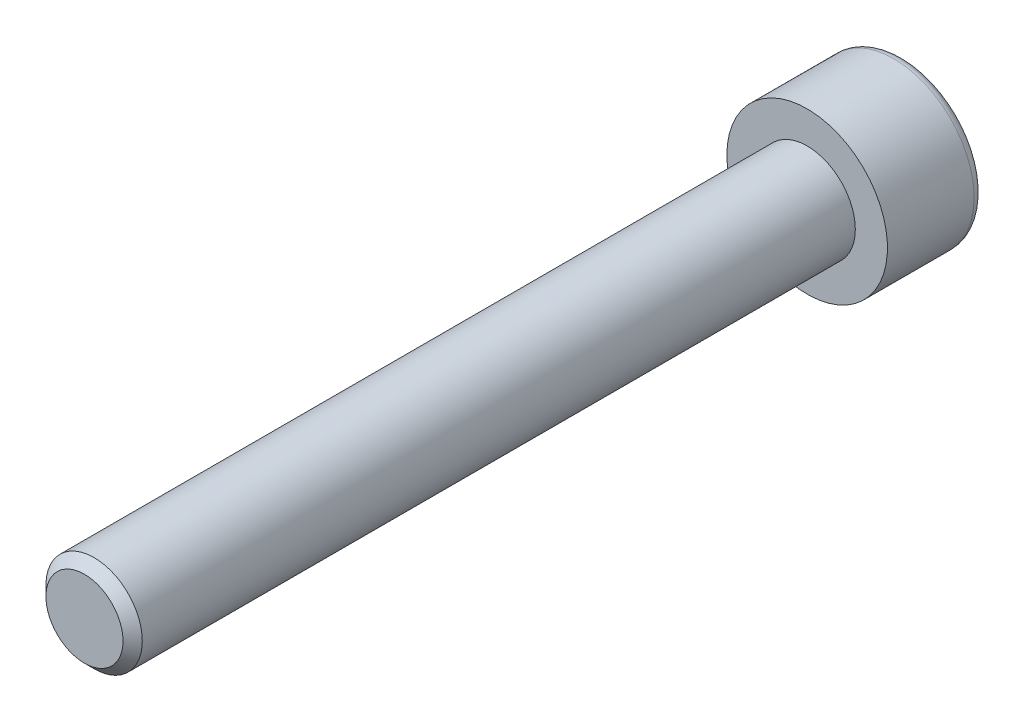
ISO-10303-21;
HEADER;
FILE_DESCRIPTION(('STEP AP214'),'2;1');
FILE_NAME('part.step','',(''),(''),'','','');
FILE_SCHEMA(('AUTOMOTIVE_DESIGN { 1 0 10303 214 1 1 1 1 }'));
ENDSEC;
DATA;
#1=APPLICATION_CONTEXT('core data for automotive mechanical design processes');
#2=APPLICATION_PROTOCOL_DEFINITION('international standard','automotive_design',2000,#1);
#3=PRODUCT_CONTEXT('',#1,'mechanical');
#4=PRODUCT('Part','Part','',(#3));
#5=PRODUCT_RELATED_PRODUCT_CATEGORY('part','',(#4));
#6=PRODUCT_DEFINITION_FORMATION('','',#4);
#7=PRODUCT_DEFINITION_CONTEXT('part definition',#1,'design');
#8=PRODUCT_DEFINITION('design','',#6,#7);
#9=PRODUCT_DEFINITION_SHAPE('','',#8);
#10=(LENGTH_UNIT() NAMED_UNIT(*) SI_UNIT(.MILLI.,.METRE.));
#11=(NAMED_UNIT(*) PLANE_ANGLE_UNIT() SI_UNIT($,.RADIAN.));
#12=(NAMED_UNIT(*) SI_UNIT($,.STERADIAN.) SOLID_ANGLE_UNIT());
#13=UNCERTAINTY_MEASURE_WITH_UNIT(LENGTH_MEASURE(1.E-05),#10,'distance_accuracy_value','');
#14=(GEOMETRIC_REPRESENTATION_CONTEXT(3) GLOBAL_UNCERTAINTY_ASSIGNED_CONTEXT((#13)) GLOBAL_UNIT_ASSIGNED_CONTEXT((#10,
#11,#12)) REPRESENTATION_CONTEXT('',''));
#15=CARTESIAN_POINT('',(0.,0.,0.));
#16=DIRECTION('',(0.,0.,1.));
#17=DIRECTION('',(1.,0.,0.));
#18=AXIS2_PLACEMENT_3D('',#15,#16,#17);
#19=CARTESIAN_POINT('',(0.,0.,-6.));
#20=DIRECTION('',(0.,0.,1.));
#21=DIRECTION('',(1.,0.,0.));
#22=AXIS2_PLACEMENT_3D('',#19,#20,#21);
#23=PLANE('',#22);
#24=CARTESIAN_POINT('',(0.,0.,-6.));
#25=DIRECTION('',(0.,0.,-1.));
#26=DIRECTION('',(-1.,0.,0.));
#27=AXIS2_PLACEMENT_3D('',#24,#25,#26);
#28=CIRCLE('',#27,4.4);
#29=CARTESIAN_POINT('',(-4.4,0.,-6.));
#30=VERTEX_POINT('',#29);
#31=EDGE_CURVE('E144',#30,#30,#28,.T.);
#32=ORIENTED_EDGE('',*,*,#31,.T.);
#33=EDGE_LOOP('',(#32));
#34=FACE_BOUND('',#33,.T.);
#35=DIRECTION('',(-0.86602540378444,0.499999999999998,0.));
#36=VECTOR('',#35,1.);
#37=CARTESIAN_POINT('',(0.,2.88675134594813,-6.));
#38=LINE('',#37,#36);
#39=CARTESIAN_POINT('',(2.5,1.44337567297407,-6.));
#40=VERTEX_POINT('',#39);
#41=CARTESIAN_POINT('',(0.,2.88675134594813,-6.));
#42=VERTEX_POINT('',#41);
#43=EDGE_CURVE('E46',#40,#42,#38,.T.);
#44=ORIENTED_EDGE('',*,*,#43,.T.);
#45=DIRECTION('',(-0.866025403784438,-0.500000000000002,0.));
#46=VECTOR('',#45,1.);
#47=CARTESIAN_POINT('',(0.,2.88675134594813,-6.));
#48=LINE('',#47,#46);
#49=CARTESIAN_POINT('',(-2.5,1.44337567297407,-6.));
#50=VERTEX_POINT('',#49);
#51=EDGE_CURVE('E117',#42,#50,#48,.T.);
#52=ORIENTED_EDGE('',*,*,#51,.T.);
#53=DIRECTION('',(0.,-1.,0.));
#54=VECTOR('',#53,1.);
#55=CARTESIAN_POINT('',(-2.5,-1.44337567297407,-6.));
#56=LINE('',#55,#54);
#57=CARTESIAN_POINT('',(-2.5,-1.44337567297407,-6.));
#58=VERTEX_POINT('',#57);
#59=EDGE_CURVE('E121',#50,#58,#56,.T.);
#60=ORIENTED_EDGE('',*,*,#59,.T.);
#61=DIRECTION('',(0.866025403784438,-0.500000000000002,0.));
#62=VECTOR('',#61,1.);
#63=CARTESIAN_POINT('',(0.,-2.88675134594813,-6.));
#64=LINE('',#63,#62);
#65=CARTESIAN_POINT('',(0.,-2.88675134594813,-6.));
#66=VERTEX_POINT('',#65);
#67=EDGE_CURVE('E124',#58,#66,#64,.T.);
#68=ORIENTED_EDGE('',*,*,#67,.T.);
#69=DIRECTION('',(0.86602540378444,0.499999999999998,0.));
#70=VECTOR('',#69,1.);
#71=CARTESIAN_POINT('',(0.,-2.88675134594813,-6.));
#72=LINE('',#71,#70);
#73=CARTESIAN_POINT('',(2.5,-1.44337567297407,-6.));
#74=VERTEX_POINT('',#73);
#75=EDGE_CURVE('E107',#66,#74,#72,.T.);
#76=ORIENTED_EDGE('',*,*,#75,.T.);
#77=DIRECTION('',(0.,1.,0.));
#78=VECTOR('',#77,1.);
#79=CARTESIAN_POINT('',(2.5,-1.44337567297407,-6.));
#80=LINE('',#79,#78);
#81=EDGE_CURVE('E127',#74,#40,#80,.T.);
#82=ORIENTED_EDGE('',*,*,#81,.T.);
#83=EDGE_LOOP('',(#44,#52,#60,#68,#76,#82));
#84=FACE_BOUND('',#83,.T.);
#85=ADVANCED_FACE('F31',(#34,#84),#23,.F.);
#86=CARTESIAN_POINT('',(0.,0.,-5.4));
#87=DIRECTION('',(0.,0.,-1.));
#88=DIRECTION('',(-1.,0.,0.));
#89=AXIS2_PLACEMENT_3D('',#86,#87,#88);
#90=TOROIDAL_SURFACE('',#89,4.4,0.600000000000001);
#91=ORIENTED_EDGE('',*,*,#31,.F.);
#92=EDGE_LOOP('',(#91));
#93=FACE_BOUND('',#92,.T.);
#94=CARTESIAN_POINT('',(0.,0.,-5.4));
#95=DIRECTION('',(0.,0.,-1.));
#96=DIRECTION('',(-1.,0.,0.));
#97=AXIS2_PLACEMENT_3D('',#94,#95,#96);
#98=CIRCLE('',#97,5.);
#99=CARTESIAN_POINT('',(-5.,0.,-5.4));
#100=VERTEX_POINT('',#99);
#101=EDGE_CURVE('E141',#100,#100,#98,.T.);
#102=ORIENTED_EDGE('',*,*,#101,.T.);
#103=EDGE_LOOP('',(#102));
#104=FACE_BOUND('',#103,.T.);
#105=ADVANCED_FACE('F161',(#93,#104),#90,.T.);
#106=CARTESIAN_POINT('',(0.,0.,0.));
#107=DIRECTION('',(0.,0.,-1.));
#108=DIRECTION('',(-1.,0.,0.));
#109=AXIS2_PLACEMENT_3D('',#106,#107,#108);
#110=CYLINDRICAL_SURFACE('',#109,5.);
#111=ORIENTED_EDGE('',*,*,#101,.F.);
#112=EDGE_LOOP('',(#111));
#113=FACE_BOUND('',#112,.T.);
#114=CARTESIAN_POINT('',(0.,0.,0.));
#115=DIRECTION('',(0.,0.,-1.));
#116=DIRECTION('',(-1.,0.,0.));
#117=AXIS2_PLACEMENT_3D('',#114,#115,#116);
#118=CIRCLE('',#117,5.);
#119=CARTESIAN_POINT('',(-5.,0.,0.));
#120=VERTEX_POINT('',#119);
#121=EDGE_CURVE('E138',#120,#120,#118,.T.);
#122=ORIENTED_EDGE('',*,*,#121,.T.);
#123=EDGE_LOOP('',(#122));
#124=FACE_BOUND('',#123,.T.);
#125=ADVANCED_FACE('F166',(#113,#124),#110,.T.);
#126=CARTESIAN_POINT('',(0.,0.,0.));
#127=DIRECTION('',(0.,0.,-1.));
#128=DIRECTION('',(-1.,0.,0.));
#129=AXIS2_PLACEMENT_3D('',#126,#127,#128);
#130=PLANE('',#129);
#131=CARTESIAN_POINT('',(0.,0.,0.));
#132=DIRECTION('',(0.,0.,1.));
#133=DIRECTION('',(1.,0.,0.));
#134=AXIS2_PLACEMENT_3D('',#131,#132,#133);
#135=CIRCLE('',#134,3.);
#136=CARTESIAN_POINT('',(3.,0.,0.));
#137=VERTEX_POINT('',#136);
#138=EDGE_CURVE('E118',#137,#137,#135,.T.);
#139=ORIENTED_EDGE('',*,*,#138,.F.);
#140=EDGE_LOOP('',(#139));
#141=FACE_BOUND('',#140,.T.);
#142=ORIENTED_EDGE('',*,*,#121,.F.);
#143=EDGE_LOOP('',(#142));
#144=FACE_BOUND('',#143,.T.);
#145=ADVANCED_FACE('F173',(#141,#144),#130,.F.);
#146=CARTESIAN_POINT('',(0.,2.88675134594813,-3.));
#147=DIRECTION('',(-0.499999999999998,-0.86602540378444,0.));
#148=DIRECTION('',(0.86602540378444,-0.499999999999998,0.));
#149=AXIS2_PLACEMENT_3D('',#146,#147,#148);
#150=PLANE('',#149);
#151=ORIENTED_EDGE('',*,*,#43,.F.);
#152=DIRECTION('',(0.,0.,-1.));
#153=VECTOR('',#152,1.);
#154=CARTESIAN_POINT('',(2.5,1.44337567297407,-3.));
#155=LINE('',#154,#153);
#156=CARTESIAN_POINT('',(2.5,1.44337567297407,-3.));
#157=VERTEX_POINT('',#156);
#158=EDGE_CURVE('E112',#157,#40,#155,.T.);
#159=ORIENTED_EDGE('',*,*,#158,.F.);
#160=DIRECTION('',(-0.86602540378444,0.499999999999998,0.));
#161=VECTOR('',#160,1.);
#162=CARTESIAN_POINT('',(0.,2.88675134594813,-3.));
#163=LINE('',#162,#161);
#164=CARTESIAN_POINT('',(0.,2.88675134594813,-3.));
#165=VERTEX_POINT('',#164);
#166=EDGE_CURVE('E130',#157,#165,#163,.T.);
#167=ORIENTED_EDGE('',*,*,#166,.T.);
#168=DIRECTION('',(0.,0.,-1.));
#169=VECTOR('',#168,1.);
#170=CARTESIAN_POINT('',(0.,2.88675134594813,-3.));
#171=LINE('',#170,#169);
#172=EDGE_CURVE('E136',#165,#42,#171,.T.);
#173=ORIENTED_EDGE('',*,*,#172,.T.);
#174=EDGE_LOOP('',(#151,#159,#167,#173));
#175=FACE_BOUND('',#174,.T.);
#176=ADVANCED_FACE('F177',(#175),#150,.T.);
#177=CARTESIAN_POINT('',(0.,2.88675134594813,-3.));
#178=DIRECTION('',(0.500000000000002,-0.866025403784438,0.));
#179=DIRECTION('',(0.866025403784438,0.500000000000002,0.));
#180=AXIS2_PLACEMENT_3D('',#177,#178,#179);
#181=PLANE('',#180);
#182=ORIENTED_EDGE('',*,*,#51,.F.);
#183=ORIENTED_EDGE('',*,*,#172,.F.);
#184=DIRECTION('',(-0.866025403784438,-0.500000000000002,0.));
#185=VECTOR('',#184,1.);
#186=CARTESIAN_POINT('',(0.,2.88675134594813,-3.));
#187=LINE('',#186,#185);
#188=CARTESIAN_POINT('',(-2.5,1.44337567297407,-3.));
#189=VERTEX_POINT('',#188);
#190=EDGE_CURVE('E85',#165,#189,#187,.T.);
#191=ORIENTED_EDGE('',*,*,#190,.T.);
#192=DIRECTION('',(0.,0.,-1.));
#193=VECTOR('',#192,1.);
#194=CARTESIAN_POINT('',(-2.5,1.44337567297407,-3.));
#195=LINE('',#194,#193);
#196=EDGE_CURVE('E134',#189,#50,#195,.T.);
#197=ORIENTED_EDGE('',*,*,#196,.T.);
#198=EDGE_LOOP('',(#182,#183,#191,#197));
#199=FACE_BOUND('',#198,.T.);
#200=ADVANCED_FACE('F181',(#199),#181,.T.);
#201=CARTESIAN_POINT('',(-2.5,-1.44337567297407,-3.));
#202=DIRECTION('',(1.,0.,0.));
#203=DIRECTION('',(0.,0.,-1.));
#204=AXIS2_PLACEMENT_3D('',#201,#202,#203);
#205=PLANE('',#204);
#206=ORIENTED_EDGE('',*,*,#59,.F.);
#207=ORIENTED_EDGE('',*,*,#196,.F.);
#208=DIRECTION('',(0.,-1.,0.));
#209=VECTOR('',#208,1.);
#210=CARTESIAN_POINT('',(-2.5,-1.44337567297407,-3.));
#211=LINE('',#210,#209);
#212=CARTESIAN_POINT('',(-2.5,-1.44337567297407,-3.));
#213=VERTEX_POINT('',#212);
#214=EDGE_CURVE('E103',#189,#213,#211,.T.);
#215=ORIENTED_EDGE('',*,*,#214,.T.);
#216=DIRECTION('',(0.,0.,-1.));
#217=VECTOR('',#216,1.);
#218=CARTESIAN_POINT('',(-2.5,-1.44337567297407,-3.));
#219=LINE('',#218,#217);
#220=EDGE_CURVE('E100',#213,#58,#219,.T.);
#221=ORIENTED_EDGE('',*,*,#220,.T.);
#222=EDGE_LOOP('',(#206,#207,#215,#221));
#223=FACE_BOUND('',#222,.T.);
#224=ADVANCED_FACE('F184',(#223),#205,.T.);
#225=CARTESIAN_POINT('',(0.,-2.88675134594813,-3.));
#226=DIRECTION('',(0.500000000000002,0.866025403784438,0.));
#227=DIRECTION('',(-0.866025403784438,0.500000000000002,0.));
#228=AXIS2_PLACEMENT_3D('',#225,#226,#227);
#229=PLANE('',#228);
#230=ORIENTED_EDGE('',*,*,#67,.F.);
#231=ORIENTED_EDGE('',*,*,#220,.F.);
#232=DIRECTION('',(0.866025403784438,-0.500000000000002,0.));
#233=VECTOR('',#232,1.);
#234=CARTESIAN_POINT('',(0.,-2.88675134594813,-3.));
#235=LINE('',#234,#233);
#236=CARTESIAN_POINT('',(0.,-2.88675134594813,-3.));
#237=VERTEX_POINT('',#236);
#238=EDGE_CURVE('E95',#213,#237,#235,.T.);
#239=ORIENTED_EDGE('',*,*,#238,.T.);
#240=DIRECTION('',(0.,0.,-1.));
#241=VECTOR('',#240,1.);
#242=CARTESIAN_POINT('',(0.,-2.88675134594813,-3.));
#243=LINE('',#242,#241);
#244=EDGE_CURVE('E99',#237,#66,#243,.T.);
#245=ORIENTED_EDGE('',*,*,#244,.T.);
#246=EDGE_LOOP('',(#230,#231,#239,#245));
#247=FACE_BOUND('',#246,.T.);
#248=ADVANCED_FACE('F98',(#247),#229,.T.);
#249=CARTESIAN_POINT('',(0.,-2.88675134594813,-3.));
#250=DIRECTION('',(-0.499999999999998,0.86602540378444,0.));
#251=DIRECTION('',(-0.86602540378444,-0.499999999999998,0.));
#252=AXIS2_PLACEMENT_3D('',#249,#250,#251);
#253=PLANE('',#252);
#254=ORIENTED_EDGE('',*,*,#75,.F.);
#255=ORIENTED_EDGE('',*,*,#244,.F.);
#256=DIRECTION('',(0.86602540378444,0.499999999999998,0.));
#257=VECTOR('',#256,1.);
#258=CARTESIAN_POINT('',(0.,-2.88675134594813,-3.));
#259=LINE('',#258,#257);
#260=CARTESIAN_POINT('',(2.5,-1.44337567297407,-3.));
#261=VERTEX_POINT('',#260);
#262=EDGE_CURVE('E102',#237,#261,#259,.T.);
#263=ORIENTED_EDGE('',*,*,#262,.T.);
#264=DIRECTION('',(0.,0.,-1.));
#265=VECTOR('',#264,1.);
#266=CARTESIAN_POINT('',(2.5,-1.44337567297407,-3.));
#267=LINE('',#266,#265);
#268=EDGE_CURVE('E76',#261,#74,#267,.T.);
#269=ORIENTED_EDGE('',*,*,#268,.T.);
#270=EDGE_LOOP('',(#254,#255,#263,#269));
#271=FACE_BOUND('',#270,.T.);
#272=ADVANCED_FACE('F105',(#271),#253,.T.);
#273=CARTESIAN_POINT('',(2.5,-1.44337567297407,-3.));
#274=DIRECTION('',(-1.,0.,0.));
#275=DIRECTION('',(0.,0.,1.));
#276=AXIS2_PLACEMENT_3D('',#273,#274,#275);
#277=PLANE('',#276);
#278=ORIENTED_EDGE('',*,*,#81,.F.);
#279=ORIENTED_EDGE('',*,*,#268,.F.);
#280=DIRECTION('',(0.,1.,0.));
#281=VECTOR('',#280,1.);
#282=CARTESIAN_POINT('',(2.5,-1.44337567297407,-3.));
#283=LINE('',#282,#281);
#284=EDGE_CURVE('E54',#261,#157,#283,.T.);
#285=ORIENTED_EDGE('',*,*,#284,.T.);
#286=ORIENTED_EDGE('',*,*,#158,.T.);
#287=EDGE_LOOP('',(#278,#279,#285,#286));
#288=FACE_BOUND('',#287,.T.);
#289=ADVANCED_FACE('F193',(#288),#277,.T.);
#290=CARTESIAN_POINT('',(2.5,1.44337567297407,-3.));
#291=DIRECTION('',(0.,0.,1.));
#292=DIRECTION('',(1.,0.,0.));
#293=AXIS2_PLACEMENT_3D('',#290,#291,#292);
#294=PLANE('',#293);
#295=ORIENTED_EDGE('',*,*,#166,.F.);
#296=ORIENTED_EDGE('',*,*,#284,.F.);
#297=ORIENTED_EDGE('',*,*,#262,.F.);
#298=ORIENTED_EDGE('',*,*,#238,.F.);
#299=ORIENTED_EDGE('',*,*,#214,.F.);
#300=ORIENTED_EDGE('',*,*,#190,.F.);
#301=EDGE_LOOP('',(#295,#296,#297,#298,#299,#300));
#302=FACE_BOUND('',#301,.T.);
#303=ADVANCED_FACE('F110',(#302),#294,.F.);
#304=CARTESIAN_POINT('',(0.,0.,45.));
#305=DIRECTION('',(0.,0.,1.));
#306=DIRECTION('',(1.,0.,0.));
#307=AXIS2_PLACEMENT_3D('',#304,#305,#306);
#308=PLANE('',#307);
#309=CARTESIAN_POINT('',(0.,0.,45.));
#310=DIRECTION('',(0.,0.,1.));
#311=DIRECTION('',(1.,0.,0.));
#312=AXIS2_PLACEMENT_3D('',#309,#310,#311);
#313=CIRCLE('',#312,2.4);
#314=CARTESIAN_POINT('',(2.4,0.,45.));
#315=VERTEX_POINT('',#314);
#316=EDGE_CURVE('E39',#315,#315,#313,.T.);
#317=ORIENTED_EDGE('',*,*,#316,.T.);
#318=EDGE_LOOP('',(#317));
#319=FACE_BOUND('',#318,.T.);
#320=ADVANCED_FACE('F149',(#319),#308,.T.);
#321=CARTESIAN_POINT('',(0.,0.,0.));
#322=DIRECTION('',(0.,0.,1.));
#323=DIRECTION('',(1.,0.,0.));
#324=AXIS2_PLACEMENT_3D('',#321,#322,#323);
#325=CYLINDRICAL_SURFACE('',#324,3.);
#326=CARTESIAN_POINT('',(0.,0.,44.4));
#327=DIRECTION('',(0.,0.,1.));
#328=DIRECTION('',(1.,0.,0.));
#329=AXIS2_PLACEMENT_3D('',#326,#327,#328);
#330=CIRCLE('',#329,3.);
#331=CARTESIAN_POINT('',(3.00000000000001,0.,44.4));
#332=VERTEX_POINT('',#331);
#333=EDGE_CURVE('E11',#332,#332,#330,.F.);
#334=ORIENTED_EDGE('',*,*,#333,.T.);
#335=EDGE_LOOP('',(#334));
#336=FACE_BOUND('',#335,.T.);
#337=ORIENTED_EDGE('',*,*,#138,.T.);
#338=EDGE_LOOP('',(#337));
#339=FACE_BOUND('',#338,.T.);
#340=ADVANCED_FACE('F152',(#336,#339),#325,.T.);
#341=CARTESIAN_POINT('',(0.,0.,45.));
#342=DIRECTION('',(0.,0.,-1.));
#343=DIRECTION('',(-1.,0.,0.));
#344=AXIS2_PLACEMENT_3D('',#341,#342,#343);
#345=CONICAL_SURFACE('',#344,2.4,0.785398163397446);
#346=ORIENTED_EDGE('',*,*,#333,.F.);
#347=EDGE_LOOP('',(#346));
#348=FACE_BOUND('',#347,.T.);
#349=ORIENTED_EDGE('',*,*,#316,.F.);
#350=EDGE_LOOP('',(#349));
#351=FACE_BOUND('',#350,.T.);
#352=ADVANCED_FACE('F33',(#348,#351),#345,.T.);
#353=CLOSED_SHELL('',(#85,#105,#125,#145,#176,#200,#224,#248,#272,#289,#303,#320,#340,#352));
#354=MANIFOLD_SOLID_BREP('B2',#353);
#355=ADVANCED_BREP_SHAPE_REPRESENTATION('',(#18,#354),#14);
#356=SHAPE_DEFINITION_REPRESENTATION(#9,#355);
ENDSEC;
END-ISO-10303-21;
